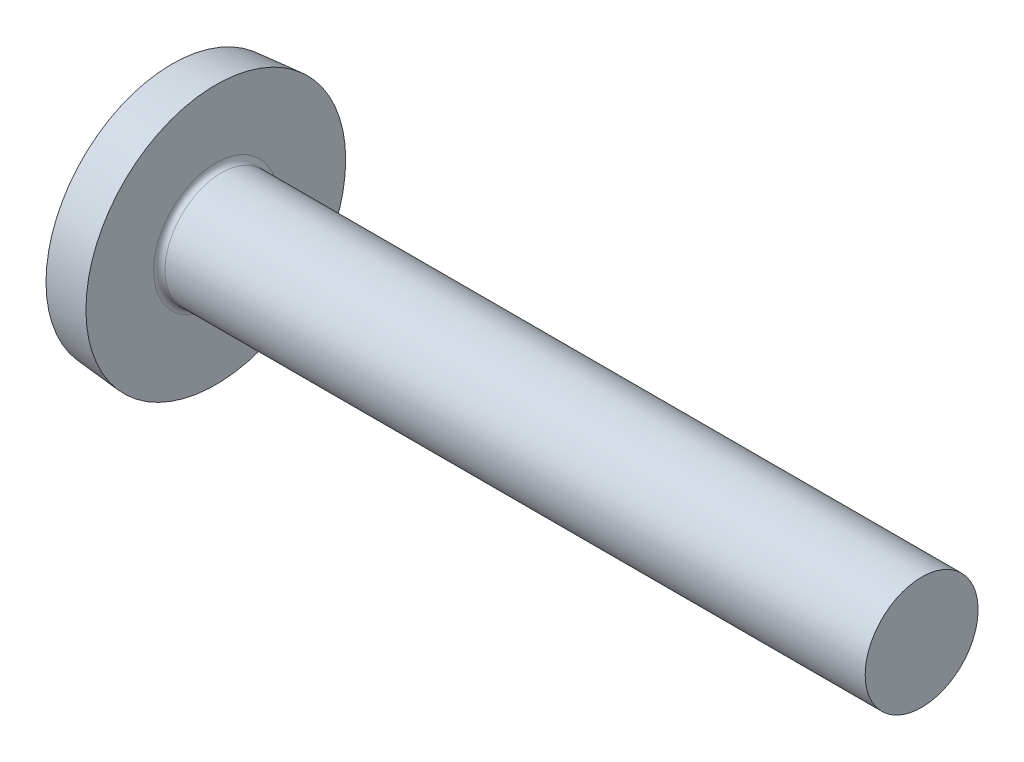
ISO-10303-21;
HEADER;
FILE_DESCRIPTION(('STEP AP214'),'2;1');
FILE_NAME('part.step','',(''),(''),'','','');
FILE_SCHEMA(('AUTOMOTIVE_DESIGN { 1 0 10303 214 1 1 1 1 }'));
ENDSEC;
DATA;
#1=APPLICATION_CONTEXT('core data for automotive mechanical design processes');
#2=APPLICATION_PROTOCOL_DEFINITION('international standard','automotive_design',2000,#1);
#3=PRODUCT_CONTEXT('',#1,'mechanical');
#4=PRODUCT('Part','Part','',(#3));
#5=PRODUCT_RELATED_PRODUCT_CATEGORY('part','',(#4));
#6=PRODUCT_DEFINITION_FORMATION('','',#4);
#7=PRODUCT_DEFINITION_CONTEXT('part definition',#1,'design');
#8=PRODUCT_DEFINITION('design','',#6,#7);
#9=PRODUCT_DEFINITION_SHAPE('','',#8);
#10=(LENGTH_UNIT() NAMED_UNIT(*) SI_UNIT(.MILLI.,.METRE.));
#11=(NAMED_UNIT(*) PLANE_ANGLE_UNIT() SI_UNIT($,.RADIAN.));
#12=(NAMED_UNIT(*) SI_UNIT($,.STERADIAN.) SOLID_ANGLE_UNIT());
#13=UNCERTAINTY_MEASURE_WITH_UNIT(LENGTH_MEASURE(1.E-05),#10,'distance_accuracy_value','');
#14=(GEOMETRIC_REPRESENTATION_CONTEXT(3) GLOBAL_UNCERTAINTY_ASSIGNED_CONTEXT((#13)) GLOBAL_UNIT_ASSIGNED_CONTEXT((#10,
#11,#12)) REPRESENTATION_CONTEXT('',''));
#15=CARTESIAN_POINT('',(0.,0.,0.));
#16=DIRECTION('',(0.,0.,1.));
#17=DIRECTION('',(1.,0.,0.));
#18=AXIS2_PLACEMENT_3D('',#15,#16,#17);
#19=CARTESIAN_POINT('',(24.2980012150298,0.,0.));
#20=DIRECTION('',(-1.,0.,0.));
#21=DIRECTION('',(0.,1.,0.));
#22=AXIS2_PLACEMENT_3D('',#19,#20,#21);
#23=SPHERICAL_SURFACE('',#22,24.2980012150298);
#24=CARTESIAN_POINT('',(1.7,0.,0.));
#25=DIRECTION('',(-1.,0.,0.));
#26=DIRECTION('',(0.,0.,1.));
#27=AXIS2_PLACEMENT_3D('',#24,#25,#26);
#28=CIRCLE('',#27,8.92878514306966);
#29=CARTESIAN_POINT('',(1.7,0.,8.92878514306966));
#30=VERTEX_POINT('',#29);
#31=EDGE_CURVE('E852',#30,#30,#28,.T.);
#32=ORIENTED_EDGE('',*,*,#31,.T.);
#33=EDGE_LOOP('',(#32));
#34=FACE_BOUND('',#33,.T.);
#35=CARTESIAN_POINT('',(0.0730330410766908,0.,0.));
#36=DIRECTION('',(1.,0.,0.));
#37=DIRECTION('',(0.,0.,-1.));
#38=AXIS2_PLACEMENT_3D('',#35,#36,#37);
#39=CIRCLE('',#38,1.88249303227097);
#40=CARTESIAN_POINT('',(0.0730330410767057,-0.857999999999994,-1.67559422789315));
#41=VERTEX_POINT('',#40);
#42=CARTESIAN_POINT('',(0.0730330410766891,-1.67559422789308,-0.858));
#43=VERTEX_POINT('',#42);
#44=EDGE_CURVE('E613',#41,#43,#39,.F.);
#45=ORIENTED_EDGE('',*,*,#44,.F.);
#46=CARTESIAN_POINT('',(24.2980012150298,-0.858000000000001,0.));
#47=DIRECTION('',(0.,1.,0.));
#48=DIRECTION('',(0.,0.,1.));
#49=AXIS2_PLACEMENT_3D('',#46,#47,#48);
#50=CIRCLE('',#49,24.2828478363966);
#51=CARTESIAN_POINT('',(0.306051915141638,-0.857999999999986,-3.74740814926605));
#52=VERTEX_POINT('',#51);
#53=EDGE_CURVE('E522',#52,#41,#50,.T.);
#54=ORIENTED_EDGE('',*,*,#53,.F.);
#55=CARTESIAN_POINT('',(21.0177911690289,0.,6.57908375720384));
#56=DIRECTION('',(-0.446197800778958,0.,0.89493436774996));
#57=DIRECTION('',(0.89493436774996,0.,0.446197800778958));
#58=AXIS2_PLACEMENT_3D('',#55,#56,#57);
#59=CIRCLE('',#58,23.1592042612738);
#60=CARTESIAN_POINT('',(0.306051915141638,0.858000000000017,-3.74740814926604));
#61=VERTEX_POINT('',#60);
#62=EDGE_CURVE('E61',#61,#52,#59,.T.);
#63=ORIENTED_EDGE('',*,*,#62,.F.);
#64=CARTESIAN_POINT('',(24.2980012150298,0.858,0.));
#65=DIRECTION('',(0.,-1.,0.));
#66=DIRECTION('',(0.,0.,-1.));
#67=AXIS2_PLACEMENT_3D('',#64,#65,#66);
#68=CIRCLE('',#67,24.2828478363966);
#69=CARTESIAN_POINT('',(0.0730330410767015,0.858000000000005,-1.67559422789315));
#70=VERTEX_POINT('',#69);
#71=EDGE_CURVE('E514',#70,#61,#68,.T.);
#72=ORIENTED_EDGE('',*,*,#71,.F.);
#73=CARTESIAN_POINT('',(0.0730330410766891,1.67559422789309,-0.858));
#74=VERTEX_POINT('',#73);
#75=EDGE_CURVE('E355',#74,#70,#39,.F.);
#76=ORIENTED_EDGE('',*,*,#75,.F.);
#77=CARTESIAN_POINT('',(24.2980012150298,0.,-0.858));
#78=DIRECTION('',(0.,0.,1.));
#79=DIRECTION('',(1.,0.,0.));
#80=AXIS2_PLACEMENT_3D('',#77,#78,#79);
#81=CIRCLE('',#80,24.2828478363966);
#82=CARTESIAN_POINT('',(0.306051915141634,3.74740814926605,-0.858));
#83=VERTEX_POINT('',#82);
#84=EDGE_CURVE('E628',#83,#74,#81,.T.);
#85=ORIENTED_EDGE('',*,*,#84,.F.);
#86=CARTESIAN_POINT('',(21.0177911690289,-6.57908375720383,0.));
#87=DIRECTION('',(-0.446197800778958,-0.89493436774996,0.));
#88=DIRECTION('',(0.89493436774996,-0.446197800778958,0.));
#89=AXIS2_PLACEMENT_3D('',#86,#87,#88);
#90=CIRCLE('',#89,23.1592042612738);
#91=CARTESIAN_POINT('',(0.306051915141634,3.74740814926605,0.858));
#92=VERTEX_POINT('',#91);
#93=EDGE_CURVE('E629',#92,#83,#90,.T.);
#94=ORIENTED_EDGE('',*,*,#93,.F.);
#95=CARTESIAN_POINT('',(24.2980012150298,0.,0.858000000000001));
#96=DIRECTION('',(0.,0.,-1.));
#97=DIRECTION('',(0.,1.,0.));
#98=AXIS2_PLACEMENT_3D('',#95,#96,#97);
#99=CIRCLE('',#98,24.2828478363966);
#100=CARTESIAN_POINT('',(0.0730330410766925,1.67559422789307,0.858));
#101=VERTEX_POINT('',#100);
#102=EDGE_CURVE('E77',#101,#92,#99,.T.);
#103=ORIENTED_EDGE('',*,*,#102,.F.);
#104=CARTESIAN_POINT('',(0.0730330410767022,0.857999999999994,1.67559422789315));
#105=VERTEX_POINT('',#104);
#106=EDGE_CURVE('E590',#105,#101,#39,.F.);
#107=ORIENTED_EDGE('',*,*,#106,.F.);
#108=CARTESIAN_POINT('',(0.306051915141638,0.857999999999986,3.74740814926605));
#109=VERTEX_POINT('',#108);
#110=EDGE_CURVE('E526',#109,#105,#68,.T.);
#111=ORIENTED_EDGE('',*,*,#110,.F.);
#112=CARTESIAN_POINT('',(21.0177911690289,0.,-6.57908375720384));
#113=DIRECTION('',(-0.446197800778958,0.,-0.89493436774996));
#114=DIRECTION('',(-0.89493436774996,0.,0.446197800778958));
#115=AXIS2_PLACEMENT_3D('',#112,#113,#114);
#116=CIRCLE('',#115,23.1592042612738);
#117=CARTESIAN_POINT('',(0.306051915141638,-0.858000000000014,3.74740814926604));
#118=VERTEX_POINT('',#117);
#119=EDGE_CURVE('E640',#118,#109,#116,.T.);
#120=ORIENTED_EDGE('',*,*,#119,.F.);
#121=CARTESIAN_POINT('',(0.073033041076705,-0.858000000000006,1.67559422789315));
#122=VERTEX_POINT('',#121);
#123=EDGE_CURVE('E525',#122,#118,#50,.T.);
#124=ORIENTED_EDGE('',*,*,#123,.F.);
#125=CARTESIAN_POINT('',(0.0730330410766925,-1.67559422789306,0.858));
#126=VERTEX_POINT('',#125);
#127=EDGE_CURVE('E610',#126,#122,#39,.F.);
#128=ORIENTED_EDGE('',*,*,#127,.F.);
#129=CARTESIAN_POINT('',(0.306051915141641,-3.74740814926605,0.858));
#130=VERTEX_POINT('',#129);
#131=EDGE_CURVE('E636',#130,#126,#99,.T.);
#132=ORIENTED_EDGE('',*,*,#131,.F.);
#133=CARTESIAN_POINT('',(21.0177911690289,6.57908375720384,0.));
#134=DIRECTION('',(-0.446197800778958,0.89493436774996,0.));
#135=DIRECTION('',(-0.89493436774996,-0.446197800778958,0.));
#136=AXIS2_PLACEMENT_3D('',#133,#134,#135);
#137=CIRCLE('',#136,23.1592042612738);
#138=CARTESIAN_POINT('',(0.306051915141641,-3.74740814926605,-0.858000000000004));
#139=VERTEX_POINT('',#138);
#140=EDGE_CURVE('E627',#139,#130,#137,.T.);
#141=ORIENTED_EDGE('',*,*,#140,.F.);
#142=EDGE_CURVE('E625',#43,#139,#81,.T.);
#143=ORIENTED_EDGE('',*,*,#142,.F.);
#144=EDGE_LOOP('',(#45,#54,#63,#72,#76,#85,#94,#103,#107,#111,#120,#124,#128,#132,#141,#143));
#145=FACE_BOUND('',#144,.T.);
#146=ADVANCED_FACE('F51',(#34,#145),#23,.T.);
#147=CARTESIAN_POINT('',(4.38,-1.71621263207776,0.858));
#148=DIRECTION('',(0.,0.,-1.));
#149=DIRECTION('',(0.,1.,0.));
#150=AXIS2_PLACEMENT_3D('',#147,#148,#149);
#151=PLANE('',#150);
#152=ORIENTED_EDGE('',*,*,#131,.T.);
#153=CARTESIAN_POINT('',(0.0300912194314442,-1.67896708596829,0.858));
#154=CARTESIAN_POINT('',(0.615803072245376,-1.63294813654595,0.858));
#155=CARTESIAN_POINT('',(1.20148851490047,-1.58658317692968,0.858));
#156=CARTESIAN_POINT('',(2.37277641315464,-1.49283617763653,0.858));
#157=CARTESIAN_POINT('',(2.95837886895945,-1.4454541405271,0.858));
#158=CARTESIAN_POINT('',(3.82269715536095,-1.3745234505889,0.858));
#159=CARTESIAN_POINT('',(4.10145559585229,-1.35149385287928,0.858));
#160=CARTESIAN_POINT('',(4.3802,-1.32829458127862,0.858));
#161=B_SPLINE_CURVE_WITH_KNOTS('',3,(#153,#154,#155,#156,#157,#158,#159,#160),.UNSPECIFIED.,.F.,
.F.,(4,2,2,4),(0.,1.76255189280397,3.52509933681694,4.36422358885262),.UNSPECIFIED.);
#162=CARTESIAN_POINT('',(4.38,-1.32831123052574,0.858));
#163=VERTEX_POINT('',#162);
#164=EDGE_CURVE('E614',#126,#163,#161,.T.);
#165=ORIENTED_EDGE('',*,*,#164,.T.);
#166=DIRECTION('',(0.,-1.,0.));
#167=VECTOR('',#166,1.);
#168=CARTESIAN_POINT('',(4.38,1.71621263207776,0.858));
#169=LINE('',#168,#167);
#170=CARTESIAN_POINT('',(4.38,-1.71621263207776,0.858));
#171=VERTEX_POINT('',#170);
#172=EDGE_CURVE('E403',#163,#171,#169,.T.);
#173=ORIENTED_EDGE('',*,*,#172,.T.);
#174=DIRECTION('',(0.89493436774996,0.446197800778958,0.));
#175=VECTOR('',#174,1.);
#176=CARTESIAN_POINT('',(0.,-3.9,0.858));
#177=LINE('',#176,#175);
#178=EDGE_CURVE('E538',#130,#171,#177,.T.);
#179=ORIENTED_EDGE('',*,*,#178,.F.);
#180=EDGE_LOOP('',(#152,#165,#173,#179));
#181=FACE_BOUND('',#180,.T.);
#182=ADVANCED_FACE('F181',(#181),#151,.T.);
#183=CARTESIAN_POINT('',(4.38,1.71621263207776,0.858));
#184=VERTEX_POINT('',#183);
#185=CARTESIAN_POINT('',(4.38,1.32831123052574,0.858));
#186=VERTEX_POINT('',#185);
#187=EDGE_CURVE('E557',#184,#186,#169,.T.);
#188=ORIENTED_EDGE('',*,*,#187,.T.);
#189=CARTESIAN_POINT('',(4.3802,1.32829458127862,0.858));
#190=CARTESIAN_POINT('',(3.88916460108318,1.36915794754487,0.858));
#191=CARTESIAN_POINT('',(3.39808595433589,1.40949733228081,0.858));
#192=CARTESIAN_POINT('',(2.415859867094,1.48932003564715,0.858));
#193=CARTESIAN_POINT('',(1.92471242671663,1.52880335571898,0.858));
#194=CARTESIAN_POINT('',(1.19964203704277,1.5865984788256,0.858));
#195=CARTESIAN_POINT('',(0.965739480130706,1.60516700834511,0.858));
#196=CARTESIAN_POINT('',(0.497923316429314,1.64216673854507,0.858));
#197=CARTESIAN_POINT('',(0.264009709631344,1.6605979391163,0.858));
#198=CARTESIAN_POINT('',(0.0300912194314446,1.67896708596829,0.858));
#199=B_SPLINE_CURVE_WITH_KNOTS('',3,(#189,#190,#191,#192,#193,#194,#195,#196,#197,#198),
.UNSPECIFIED.,.F.,.F.,(4,2,2,2,4),(0.,1.47819752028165,2.95639255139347,3.66030784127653,
4.36422369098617),.UNSPECIFIED.);
#200=EDGE_CURVE('E609',#186,#101,#199,.T.);
#201=ORIENTED_EDGE('',*,*,#200,.T.);
#202=ORIENTED_EDGE('',*,*,#102,.T.);
#203=DIRECTION('',(0.89493436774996,-0.446197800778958,0.));
#204=VECTOR('',#203,1.);
#205=CARTESIAN_POINT('',(0.,3.9,0.858));
#206=LINE('',#205,#204);
#207=EDGE_CURVE('E535',#92,#184,#206,.T.);
#208=ORIENTED_EDGE('',*,*,#207,.T.);
#209=EDGE_LOOP('',(#188,#201,#202,#208));
#210=FACE_BOUND('',#209,.T.);
#211=ADVANCED_FACE('F186',(#210),#151,.T.);
#212=CARTESIAN_POINT('',(4.38,1.71621263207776,-0.858));
#213=DIRECTION('',(0.,0.,1.));
#214=DIRECTION('',(1.,0.,0.));
#215=AXIS2_PLACEMENT_3D('',#212,#213,#214);
#216=PLANE('',#215);
#217=DIRECTION('',(0.,1.,0.));
#218=VECTOR('',#217,1.);
#219=CARTESIAN_POINT('',(4.38,1.71621263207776,-0.858));
#220=LINE('',#219,#218);
#221=CARTESIAN_POINT('',(4.38,-1.71621263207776,-0.858));
#222=VERTEX_POINT('',#221);
#223=CARTESIAN_POINT('',(4.38,-1.32831123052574,-0.858));
#224=VERTEX_POINT('',#223);
#225=EDGE_CURVE('E555',#222,#224,#220,.T.);
#226=ORIENTED_EDGE('',*,*,#225,.T.);
#227=CARTESIAN_POINT('',(4.3802,-1.32829458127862,-0.858));
#228=CARTESIAN_POINT('',(3.88916460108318,-1.36915794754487,-0.858));
#229=CARTESIAN_POINT('',(3.39808595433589,-1.40949733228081,-0.858));
#230=CARTESIAN_POINT('',(2.415859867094,-1.48932003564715,-0.858));
#231=CARTESIAN_POINT('',(1.92471242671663,-1.52880335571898,-0.858));
#232=CARTESIAN_POINT('',(1.19964203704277,-1.5865984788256,-0.858));
#233=CARTESIAN_POINT('',(0.965739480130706,-1.60516700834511,-0.858));
#234=CARTESIAN_POINT('',(0.497923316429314,-1.64216673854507,-0.858));
#235=CARTESIAN_POINT('',(0.264009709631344,-1.6605979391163,-0.858));
#236=CARTESIAN_POINT('',(0.0300912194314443,-1.67896708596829,-0.858));
#237=B_SPLINE_CURVE_WITH_KNOTS('',3,(#227,#228,#229,#230,#231,#232,#233,#234,#235,#236),
.UNSPECIFIED.,.F.,.F.,(4,2,2,2,4),(0.,1.47819752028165,2.95639255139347,3.66030784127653,
4.36422369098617),.UNSPECIFIED.);
#238=EDGE_CURVE('E618',#224,#43,#237,.T.);
#239=ORIENTED_EDGE('',*,*,#238,.T.);
#240=ORIENTED_EDGE('',*,*,#142,.T.);
#241=DIRECTION('',(0.89493436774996,0.446197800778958,0.));
#242=VECTOR('',#241,1.);
#243=CARTESIAN_POINT('',(0.,-3.9,-0.858000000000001));
#244=LINE('',#243,#242);
#245=EDGE_CURVE('E534',#139,#222,#244,.T.);
#246=ORIENTED_EDGE('',*,*,#245,.T.);
#247=EDGE_LOOP('',(#226,#239,#240,#246));
#248=FACE_BOUND('',#247,.T.);
#249=ADVANCED_FACE('F363',(#248),#216,.T.);
#250=ORIENTED_EDGE('',*,*,#84,.T.);
#251=CARTESIAN_POINT('',(0.0300912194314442,1.67896708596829,-0.858));
#252=CARTESIAN_POINT('',(0.615803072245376,1.63294813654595,-0.858));
#253=CARTESIAN_POINT('',(1.20148851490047,1.58658317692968,-0.858));
#254=CARTESIAN_POINT('',(2.37277641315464,1.49283617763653,-0.858));
#255=CARTESIAN_POINT('',(2.95837886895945,1.4454541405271,-0.858));
#256=CARTESIAN_POINT('',(3.82269715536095,1.3745234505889,-0.858));
#257=CARTESIAN_POINT('',(4.10145559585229,1.35149385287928,-0.858));
#258=CARTESIAN_POINT('',(4.3802,1.32829458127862,-0.858));
#259=B_SPLINE_CURVE_WITH_KNOTS('',3,(#251,#252,#253,#254,#255,#256,#257,#258),.UNSPECIFIED.,.F.,
.F.,(4,2,2,4),(0.,1.76255189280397,3.52509933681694,4.36422358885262),.UNSPECIFIED.);
#260=CARTESIAN_POINT('',(4.38,1.32831123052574,-0.858));
#261=VERTEX_POINT('',#260);
#262=EDGE_CURVE('E352',#74,#261,#259,.T.);
#263=ORIENTED_EDGE('',*,*,#262,.T.);
#264=CARTESIAN_POINT('',(4.38,1.71621263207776,-0.858));
#265=VERTEX_POINT('',#264);
#266=EDGE_CURVE('E391',#261,#265,#220,.T.);
#267=ORIENTED_EDGE('',*,*,#266,.T.);
#268=DIRECTION('',(0.89493436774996,-0.446197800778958,0.));
#269=VECTOR('',#268,1.);
#270=CARTESIAN_POINT('',(0.,3.9,-0.858));
#271=LINE('',#270,#269);
#272=EDGE_CURVE('E532',#83,#265,#271,.T.);
#273=ORIENTED_EDGE('',*,*,#272,.F.);
#274=EDGE_LOOP('',(#250,#263,#267,#273));
#275=FACE_BOUND('',#274,.T.);
#276=ADVANCED_FACE('F214',(#275),#216,.T.);
#277=CARTESIAN_POINT('',(4.38,-1.71621263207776,0.858));
#278=DIRECTION('',(1.,0.,0.));
#279=DIRECTION('',(0.,0.,-1.));
#280=AXIS2_PLACEMENT_3D('',#277,#278,#279);
#281=PLANE('',#280);
#282=CARTESIAN_POINT('',(4.38,0.,0.));
#283=DIRECTION('',(-1.,0.,0.));
#284=DIRECTION('',(0.,0.,1.));
#285=AXIS2_PLACEMENT_3D('',#282,#283,#284);
#286=CIRCLE('',#285,1.58132056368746);
#287=EDGE_CURVE('E566',#224,#163,#286,.T.);
#288=ORIENTED_EDGE('',*,*,#287,.F.);
#289=ORIENTED_EDGE('',*,*,#225,.F.);
#290=DIRECTION('',(0.,0.,-1.));
#291=VECTOR('',#290,1.);
#292=CARTESIAN_POINT('',(4.38,-1.71621263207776,0.858));
#293=LINE('',#292,#291);
#294=EDGE_CURVE('E422',#171,#222,#293,.T.);
#295=ORIENTED_EDGE('',*,*,#294,.F.);
#296=ORIENTED_EDGE('',*,*,#172,.F.);
#297=EDGE_LOOP('',(#288,#289,#295,#296));
#298=FACE_BOUND('',#297,.T.);
#299=ADVANCED_FACE('F209',(#298),#281,.F.);
#300=CARTESIAN_POINT('',(4.38,-0.858000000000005,1.32831123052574));
#301=VERTEX_POINT('',#300);
#302=CARTESIAN_POINT('',(4.38,0.857999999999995,1.32831123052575));
#303=VERTEX_POINT('',#302);
#304=EDGE_CURVE('E582',#301,#303,#286,.T.);
#305=ORIENTED_EDGE('',*,*,#304,.F.);
#306=DIRECTION('',(0.,0.,-1.));
#307=VECTOR('',#306,1.);
#308=CARTESIAN_POINT('',(4.38,-0.858000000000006,1.71621263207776));
#309=LINE('',#308,#307);
#310=CARTESIAN_POINT('',(4.38,-0.858000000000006,1.71621263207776));
#311=VERTEX_POINT('',#310);
#312=EDGE_CURVE('E55',#311,#301,#309,.T.);
#313=ORIENTED_EDGE('',*,*,#312,.F.);
#314=DIRECTION('',(0.,-1.,0.));
#315=VECTOR('',#314,1.);
#316=CARTESIAN_POINT('',(4.38,-0.858000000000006,1.71621263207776));
#317=LINE('',#316,#315);
#318=CARTESIAN_POINT('',(4.38,0.857999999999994,1.71621263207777));
#319=VERTEX_POINT('',#318);
#320=EDGE_CURVE('E495',#319,#311,#317,.T.);
#321=ORIENTED_EDGE('',*,*,#320,.F.);
#322=DIRECTION('',(0.,0.,1.));
#323=VECTOR('',#322,1.);
#324=CARTESIAN_POINT('',(4.38,0.857999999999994,1.71621263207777));
#325=LINE('',#324,#323);
#326=EDGE_CURVE('E288',#303,#319,#325,.T.);
#327=ORIENTED_EDGE('',*,*,#326,.F.);
#328=EDGE_LOOP('',(#305,#313,#321,#327));
#329=FACE_BOUND('',#328,.T.);
#330=ADVANCED_FACE('F213',(#329),#281,.F.);
#331=EDGE_CURVE('E560',#186,#261,#286,.T.);
#332=ORIENTED_EDGE('',*,*,#331,.F.);
#333=ORIENTED_EDGE('',*,*,#187,.F.);
#334=DIRECTION('',(0.,0.,1.));
#335=VECTOR('',#334,1.);
#336=CARTESIAN_POINT('',(4.38,1.71621263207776,0.858));
#337=LINE('',#336,#335);
#338=EDGE_CURVE('E545',#265,#184,#337,.T.);
#339=ORIENTED_EDGE('',*,*,#338,.F.);
#340=ORIENTED_EDGE('',*,*,#266,.F.);
#341=EDGE_LOOP('',(#332,#333,#339,#340));
#342=FACE_BOUND('',#341,.T.);
#343=ADVANCED_FACE('F558',(#342),#281,.F.);
#344=CARTESIAN_POINT('',(4.38,0.858000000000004,-1.32831123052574));
#345=VERTEX_POINT('',#344);
#346=CARTESIAN_POINT('',(4.38,-0.857999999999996,-1.32831123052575));
#347=VERTEX_POINT('',#346);
#348=EDGE_CURVE('E491',#345,#347,#286,.T.);
#349=ORIENTED_EDGE('',*,*,#348,.F.);
#350=CARTESIAN_POINT('',(4.38,0.858000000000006,-1.71621263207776));
#351=VERTEX_POINT('',#350);
#352=EDGE_CURVE('E488',#351,#345,#325,.T.);
#353=ORIENTED_EDGE('',*,*,#352,.F.);
#354=DIRECTION('',(0.,1.,0.));
#355=VECTOR('',#354,1.);
#356=CARTESIAN_POINT('',(4.38,-0.857999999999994,-1.71621263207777));
#357=LINE('',#356,#355);
#358=CARTESIAN_POINT('',(4.38,-0.857999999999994,-1.71621263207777));
#359=VERTEX_POINT('',#358);
#360=EDGE_CURVE('E489',#359,#351,#357,.T.);
#361=ORIENTED_EDGE('',*,*,#360,.F.);
#362=EDGE_CURVE('E354',#347,#359,#309,.T.);
#363=ORIENTED_EDGE('',*,*,#362,.F.);
#364=EDGE_LOOP('',(#349,#353,#361,#363));
#365=FACE_BOUND('',#364,.T.);
#366=ADVANCED_FACE('F216',(#365),#281,.F.);
#367=CARTESIAN_POINT('',(4.38,0.857999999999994,1.71621263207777));
#368=DIRECTION('',(0.,-1.,0.));
#369=DIRECTION('',(1.,0.,0.));
#370=AXIS2_PLACEMENT_3D('',#367,#368,#369);
#371=PLANE('',#370);
#372=ORIENTED_EDGE('',*,*,#352,.T.);
#373=CARTESIAN_POINT('',(4.3802,0.858000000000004,-1.32829458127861));
#374=CARTESIAN_POINT('',(3.88916460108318,0.858000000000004,-1.36915794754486));
#375=CARTESIAN_POINT('',(3.39808595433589,0.858000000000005,-1.4094973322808));
#376=CARTESIAN_POINT('',(2.415859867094,0.858000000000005,-1.48932003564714));
#377=CARTESIAN_POINT('',(1.92471242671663,0.858000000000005,-1.52880335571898));
#378=CARTESIAN_POINT('',(1.19964203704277,0.858000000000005,-1.5865984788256));
#379=CARTESIAN_POINT('',(0.965739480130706,0.858000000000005,-1.60516700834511));
#380=CARTESIAN_POINT('',(0.497923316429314,0.858000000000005,-1.64216673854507));
#381=CARTESIAN_POINT('',(0.264009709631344,0.858000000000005,-1.66059793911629));
#382=CARTESIAN_POINT('',(0.0300912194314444,0.858000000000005,-1.67896708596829));
#383=B_SPLINE_CURVE_WITH_KNOTS('',3,(#373,#374,#375,#376,#377,#378,#379,#380,#381,#382),
.UNSPECIFIED.,.F.,.F.,(4,2,2,2,4),(0.,1.47819752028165,2.95639255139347,3.66030784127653,
4.36422369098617),.UNSPECIFIED.);
#384=EDGE_CURVE('E351',#345,#70,#383,.T.);
#385=ORIENTED_EDGE('',*,*,#384,.T.);
#386=ORIENTED_EDGE('',*,*,#71,.T.);
#387=DIRECTION('',(0.89493436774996,0.,0.446197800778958));
#388=VECTOR('',#387,1.);
#389=CARTESIAN_POINT('',(0.,0.858000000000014,-3.9));
#390=LINE('',#389,#388);
#391=EDGE_CURVE('E500',#61,#351,#390,.T.);
#392=ORIENTED_EDGE('',*,*,#391,.T.);
#393=EDGE_LOOP('',(#372,#385,#386,#392));
#394=FACE_BOUND('',#393,.T.);
#395=ADVANCED_FACE('F298',(#394),#371,.T.);
#396=CARTESIAN_POINT('',(4.38,-0.857999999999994,-1.71621263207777));
#397=DIRECTION('',(0.,1.,0.));
#398=DIRECTION('',(0.,0.,1.));
#399=AXIS2_PLACEMENT_3D('',#396,#397,#398);
#400=PLANE('',#399);
#401=ORIENTED_EDGE('',*,*,#53,.T.);
#402=CARTESIAN_POINT('',(0.0300912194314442,-0.857999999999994,-1.6789670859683));
#403=CARTESIAN_POINT('',(0.615803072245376,-0.857999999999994,-1.63294813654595));
#404=CARTESIAN_POINT('',(1.20148851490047,-0.857999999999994,-1.58658317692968));
#405=CARTESIAN_POINT('',(2.37277641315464,-0.857999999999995,-1.49283617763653));
#406=CARTESIAN_POINT('',(2.95837886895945,-0.857999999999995,-1.44545414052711));
#407=CARTESIAN_POINT('',(3.82269715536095,-0.857999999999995,-1.3745234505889));
#408=CARTESIAN_POINT('',(4.10145559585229,-0.857999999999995,-1.35149385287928));
#409=CARTESIAN_POINT('',(4.3802,-0.857999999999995,-1.32829458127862));
#410=B_SPLINE_CURVE_WITH_KNOTS('',3,(#402,#403,#404,#405,#406,#407,#408,#409),.UNSPECIFIED.,.F.,
.F.,(4,2,2,4),(0.,1.76255189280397,3.52509933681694,4.36422358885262),.UNSPECIFIED.);
#411=EDGE_CURVE('E617',#41,#347,#410,.T.);
#412=ORIENTED_EDGE('',*,*,#411,.T.);
#413=ORIENTED_EDGE('',*,*,#362,.T.);
#414=DIRECTION('',(0.89493436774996,0.,0.446197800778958));
#415=VECTOR('',#414,1.);
#416=CARTESIAN_POINT('',(0.,-0.857999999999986,-3.9));
#417=LINE('',#416,#415);
#418=EDGE_CURVE('E503',#52,#359,#417,.T.);
#419=ORIENTED_EDGE('',*,*,#418,.F.);
#420=EDGE_LOOP('',(#401,#412,#413,#419));
#421=FACE_BOUND('',#420,.T.);
#422=ADVANCED_FACE('F459',(#421),#400,.T.);
#423=ORIENTED_EDGE('',*,*,#312,.T.);
#424=CARTESIAN_POINT('',(4.3802,-0.858000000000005,1.32829458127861));
#425=CARTESIAN_POINT('',(3.88916460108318,-0.858000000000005,1.36915794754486));
#426=CARTESIAN_POINT('',(3.39808595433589,-0.858000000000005,1.4094973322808));
#427=CARTESIAN_POINT('',(2.415859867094,-0.858000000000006,1.48932003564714));
#428=CARTESIAN_POINT('',(1.92471242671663,-0.858000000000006,1.52880335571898));
#429=CARTESIAN_POINT('',(1.19964203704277,-0.858000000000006,1.5865984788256));
#430=CARTESIAN_POINT('',(0.965739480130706,-0.858000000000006,1.60516700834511));
#431=CARTESIAN_POINT('',(0.497923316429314,-0.858000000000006,1.64216673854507));
#432=CARTESIAN_POINT('',(0.264009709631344,-0.858000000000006,1.66059793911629));
#433=CARTESIAN_POINT('',(0.0300912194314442,-0.858000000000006,1.67896708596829));
#434=B_SPLINE_CURVE_WITH_KNOTS('',3,(#424,#425,#426,#427,#428,#429,#430,#431,#432,#433),
.UNSPECIFIED.,.F.,.F.,(4,2,2,2,4),(0.,1.47819752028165,2.95639255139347,3.66030784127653,
4.36422369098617),.UNSPECIFIED.);
#435=EDGE_CURVE('E612',#301,#122,#434,.T.);
#436=ORIENTED_EDGE('',*,*,#435,.T.);
#437=ORIENTED_EDGE('',*,*,#123,.T.);
#438=DIRECTION('',(0.89493436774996,0.,-0.446197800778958));
#439=VECTOR('',#438,1.);
#440=CARTESIAN_POINT('',(0.,-0.858000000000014,3.9));
#441=LINE('',#440,#439);
#442=EDGE_CURVE('E512',#118,#311,#441,.T.);
#443=ORIENTED_EDGE('',*,*,#442,.T.);
#444=EDGE_LOOP('',(#423,#436,#437,#443));
#445=FACE_BOUND('',#444,.T.);
#446=ADVANCED_FACE('F467',(#445),#400,.T.);
#447=ORIENTED_EDGE('',*,*,#110,.T.);
#448=CARTESIAN_POINT('',(0.0300912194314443,0.857999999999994,1.6789670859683));
#449=CARTESIAN_POINT('',(0.615803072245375,0.857999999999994,1.63294813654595));
#450=CARTESIAN_POINT('',(1.20148851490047,0.857999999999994,1.58658317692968));
#451=CARTESIAN_POINT('',(2.37277641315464,0.857999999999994,1.49283617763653));
#452=CARTESIAN_POINT('',(2.95837886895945,0.857999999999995,1.44545414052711));
#453=CARTESIAN_POINT('',(3.82269715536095,0.857999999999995,1.3745234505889));
#454=CARTESIAN_POINT('',(4.10145559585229,0.857999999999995,1.35149385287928));
#455=CARTESIAN_POINT('',(4.3802,0.857999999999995,1.32829458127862));
#456=B_SPLINE_CURVE_WITH_KNOTS('',3,(#448,#449,#450,#451,#452,#453,#454,#455),.UNSPECIFIED.,.F.,
.F.,(4,2,2,4),(0.,1.76255189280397,3.52509933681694,4.36422358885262),.UNSPECIFIED.);
#457=EDGE_CURVE('E12',#105,#303,#456,.T.);
#458=ORIENTED_EDGE('',*,*,#457,.T.);
#459=ORIENTED_EDGE('',*,*,#326,.T.);
#460=DIRECTION('',(0.89493436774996,0.,-0.446197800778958));
#461=VECTOR('',#460,1.);
#462=CARTESIAN_POINT('',(0.,0.857999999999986,3.9));
#463=LINE('',#462,#461);
#464=EDGE_CURVE('E509',#109,#319,#463,.T.);
#465=ORIENTED_EDGE('',*,*,#464,.F.);
#466=EDGE_LOOP('',(#447,#458,#459,#465));
#467=FACE_BOUND('',#466,.T.);
#468=ADVANCED_FACE('F196',(#467),#371,.T.);
#469=CARTESIAN_POINT('',(4.8,0.,0.));
#470=DIRECTION('',(1.,0.,0.));
#471=DIRECTION('',(0.,0.,-1.));
#472=AXIS2_PLACEMENT_3D('',#469,#470,#471);
#473=CONICAL_SURFACE('',#472,9.2,0.0872664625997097);
#474=ORIENTED_EDGE('',*,*,#31,.F.);
#475=EDGE_LOOP('',(#474));
#476=FACE_BOUND('',#475,.T.);
#477=CARTESIAN_POINT('',(4.8,0.,0.));
#478=DIRECTION('',(-1.,0.,0.));
#479=DIRECTION('',(0.,0.,1.));
#480=AXIS2_PLACEMENT_3D('',#477,#478,#479);
#481=CIRCLE('',#480,9.2);
#482=CARTESIAN_POINT('',(4.8,0.,9.2));
#483=VERTEX_POINT('',#482);
#484=EDGE_CURVE('E854',#483,#483,#481,.T.);
#485=ORIENTED_EDGE('',*,*,#484,.T.);
#486=EDGE_LOOP('',(#485));
#487=FACE_BOUND('',#486,.T.);
#488=ADVANCED_FACE('F192',(#476,#487),#473,.T.);
#489=CARTESIAN_POINT('',(4.8,4.,0.));
#490=DIRECTION('',(-1.,0.,0.));
#491=DIRECTION('',(0.,0.,1.));
#492=AXIS2_PLACEMENT_3D('',#489,#490,#491);
#493=PLANE('',#492);
#494=CARTESIAN_POINT('',(4.8,0.,0.));
#495=DIRECTION('',(-1.,0.,0.));
#496=DIRECTION('',(0.,0.,1.));
#497=AXIS2_PLACEMENT_3D('',#494,#495,#496);
#498=CIRCLE('',#497,4.4);
#499=CARTESIAN_POINT('',(4.8,0.,4.4));
#500=VERTEX_POINT('',#499);
#501=EDGE_CURVE('E851',#500,#500,#498,.T.);
#502=ORIENTED_EDGE('',*,*,#501,.T.);
#503=EDGE_LOOP('',(#502));
#504=FACE_BOUND('',#503,.T.);
#505=ORIENTED_EDGE('',*,*,#484,.F.);
#506=EDGE_LOOP('',(#505));
#507=FACE_BOUND('',#506,.T.);
#508=ADVANCED_FACE('F195',(#504,#507),#493,.F.);
#509=CARTESIAN_POINT('',(0.,0.,0.));
#510=DIRECTION('',(-1.,0.,0.));
#511=DIRECTION('',(0.,0.,1.));
#512=AXIS2_PLACEMENT_3D('',#509,#510,#511);
#513=CYLINDRICAL_SURFACE('',#512,4.);
#514=CARTESIAN_POINT('',(5.2,0.,0.));
#515=DIRECTION('',(-1.,0.,0.));
#516=DIRECTION('',(0.,0.,1.));
#517=AXIS2_PLACEMENT_3D('',#514,#515,#516);
#518=CIRCLE('',#517,4.);
#519=CARTESIAN_POINT('',(5.2,0.,4.));
#520=VERTEX_POINT('',#519);
#521=EDGE_CURVE('E632',#520,#520,#518,.F.);
#522=ORIENTED_EDGE('',*,*,#521,.T.);
#523=EDGE_LOOP('',(#522));
#524=FACE_BOUND('',#523,.T.);
#525=CARTESIAN_POINT('',(54.8,0.,0.));
#526=DIRECTION('',(-1.,0.,0.));
#527=DIRECTION('',(0.,0.,1.));
#528=AXIS2_PLACEMENT_3D('',#525,#526,#527);
#529=CIRCLE('',#528,4.);
#530=CARTESIAN_POINT('',(54.8,0.,4.));
#531=VERTEX_POINT('',#530);
#532=EDGE_CURVE('E858',#531,#531,#529,.T.);
#533=ORIENTED_EDGE('',*,*,#532,.T.);
#534=EDGE_LOOP('',(#533));
#535=FACE_BOUND('',#534,.T.);
#536=ADVANCED_FACE('F200',(#524,#535),#513,.T.);
#537=CARTESIAN_POINT('',(54.8,4.,0.));
#538=DIRECTION('',(-1.,0.,0.));
#539=DIRECTION('',(0.,0.,1.));
#540=AXIS2_PLACEMENT_3D('',#537,#538,#539);
#541=PLANE('',#540);
#542=ORIENTED_EDGE('',*,*,#532,.F.);
#543=EDGE_LOOP('',(#542));
#544=FACE_BOUND('',#543,.T.);
#545=ADVANCED_FACE('F204',(#544),#541,.F.);
#546=CARTESIAN_POINT('',(5.2,0.,0.));
#547=DIRECTION('',(-1.,0.,0.));
#548=DIRECTION('',(0.,0.,1.));
#549=AXIS2_PLACEMENT_3D('',#546,#547,#548);
#550=TOROIDAL_SURFACE('',#549,4.4,0.4);
#551=ORIENTED_EDGE('',*,*,#521,.F.);
#552=EDGE_LOOP('',(#551));
#553=FACE_BOUND('',#552,.T.);
#554=ORIENTED_EDGE('',*,*,#501,.F.);
#555=EDGE_LOOP('',(#554));
#556=FACE_BOUND('',#555,.T.);
#557=ADVANCED_FACE('F53',(#553,#556),#550,.F.);
#558=CARTESIAN_POINT('',(0.,-3.9,-0.858));
#559=DIRECTION('',(-0.446197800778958,0.89493436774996,0.));
#560=DIRECTION('',(-0.89493436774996,-0.446197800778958,0.));
#561=AXIS2_PLACEMENT_3D('',#558,#559,#560);
#562=PLANE('',#561);
#563=ORIENTED_EDGE('',*,*,#140,.T.);
#564=ORIENTED_EDGE('',*,*,#178,.T.);
#565=ORIENTED_EDGE('',*,*,#294,.T.);
#566=ORIENTED_EDGE('',*,*,#245,.F.);
#567=EDGE_LOOP('',(#563,#564,#565,#566));
#568=FACE_BOUND('',#567,.T.);
#569=ADVANCED_FACE('F425',(#568),#562,.T.);
#570=CARTESIAN_POINT('',(4.38,1.71621263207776,0.858));
#571=DIRECTION('',(-0.446197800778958,-0.89493436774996,0.));
#572=DIRECTION('',(0.89493436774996,-0.446197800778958,0.));
#573=AXIS2_PLACEMENT_3D('',#570,#571,#572);
#574=PLANE('',#573);
#575=ORIENTED_EDGE('',*,*,#93,.T.);
#576=ORIENTED_EDGE('',*,*,#272,.T.);
#577=ORIENTED_EDGE('',*,*,#338,.T.);
#578=ORIENTED_EDGE('',*,*,#207,.F.);
#579=EDGE_LOOP('',(#575,#576,#577,#578));
#580=FACE_BOUND('',#579,.T.);
#581=ADVANCED_FACE('F217',(#580),#574,.T.);
#582=CARTESIAN_POINT('',(0.,0.858000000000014,-3.9));
#583=DIRECTION('',(-0.446197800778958,0.,0.89493436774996));
#584=DIRECTION('',(-0.89493436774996,0.,-0.446197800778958));
#585=AXIS2_PLACEMENT_3D('',#582,#583,#584);
#586=PLANE('',#585);
#587=ORIENTED_EDGE('',*,*,#62,.T.);
#588=ORIENTED_EDGE('',*,*,#418,.T.);
#589=ORIENTED_EDGE('',*,*,#360,.T.);
#590=ORIENTED_EDGE('',*,*,#391,.F.);
#591=EDGE_LOOP('',(#587,#588,#589,#590));
#592=FACE_BOUND('',#591,.T.);
#593=ADVANCED_FACE('F304',(#592),#586,.T.);
#594=CARTESIAN_POINT('',(4.38,-0.858000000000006,1.71621263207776));
#595=DIRECTION('',(-0.446197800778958,0.,-0.89493436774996));
#596=DIRECTION('',(0.89493436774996,0.,-0.446197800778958));
#597=AXIS2_PLACEMENT_3D('',#594,#595,#596);
#598=PLANE('',#597);
#599=ORIENTED_EDGE('',*,*,#119,.T.);
#600=ORIENTED_EDGE('',*,*,#464,.T.);
#601=ORIENTED_EDGE('',*,*,#320,.T.);
#602=ORIENTED_EDGE('',*,*,#442,.F.);
#603=EDGE_LOOP('',(#599,#600,#601,#602));
#604=FACE_BOUND('',#603,.T.);
#605=ADVANCED_FACE('F433',(#604),#598,.T.);
#606=CARTESIAN_POINT('',(4.38,0.,0.));
#607=DIRECTION('',(-1.,0.,0.));
#608=DIRECTION('',(0.,0.,1.));
#609=AXIS2_PLACEMENT_3D('',#606,#607,#608);
#610=CONICAL_SURFACE('',#609,1.58132056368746,0.0698131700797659);
#611=ORIENTED_EDGE('',*,*,#75,.T.);
#612=ORIENTED_EDGE('',*,*,#384,.F.);
#613=EDGE_CURVE('E600',#261,#345,#286,.T.);
#614=ORIENTED_EDGE('',*,*,#613,.F.);
#615=ORIENTED_EDGE('',*,*,#262,.F.);
#616=EDGE_LOOP('',(#611,#612,#614,#615));
#617=FACE_BOUND('',#616,.T.);
#618=ADVANCED_FACE('F179',(#617),#610,.F.);
#619=EDGE_CURVE('E605',#347,#224,#286,.T.);
#620=ORIENTED_EDGE('',*,*,#619,.F.);
#621=ORIENTED_EDGE('',*,*,#411,.F.);
#622=ORIENTED_EDGE('',*,*,#44,.T.);
#623=ORIENTED_EDGE('',*,*,#238,.F.);
#624=EDGE_LOOP('',(#620,#621,#622,#623));
#625=FACE_BOUND('',#624,.T.);
#626=ADVANCED_FACE('F622',(#625),#610,.F.);
#627=ORIENTED_EDGE('',*,*,#127,.T.);
#628=ORIENTED_EDGE('',*,*,#435,.F.);
#629=EDGE_CURVE('E584',#163,#301,#286,.T.);
#630=ORIENTED_EDGE('',*,*,#629,.F.);
#631=ORIENTED_EDGE('',*,*,#164,.F.);
#632=EDGE_LOOP('',(#627,#628,#630,#631));
#633=FACE_BOUND('',#632,.T.);
#634=ADVANCED_FACE('F177',(#633),#610,.F.);
#635=EDGE_CURVE('E69',#303,#186,#286,.T.);
#636=ORIENTED_EDGE('',*,*,#635,.F.);
#637=ORIENTED_EDGE('',*,*,#457,.F.);
#638=ORIENTED_EDGE('',*,*,#106,.T.);
#639=ORIENTED_EDGE('',*,*,#200,.F.);
#640=EDGE_LOOP('',(#636,#637,#638,#639));
#641=FACE_BOUND('',#640,.T.);
#642=ADVANCED_FACE('F171',(#641),#610,.F.);
#643=CARTESIAN_POINT('',(4.89380219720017,0.,0.));
#644=DIRECTION('',(-1.,0.,0.));
#645=DIRECTION('',(0.,0.,1.));
#646=AXIS2_PLACEMENT_3D('',#643,#644,#645);
#647=CONICAL_SURFACE('',#646,0.,1.25663706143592);
#648=ORIENTED_EDGE('',*,*,#635,.T.);
#649=ORIENTED_EDGE('',*,*,#331,.T.);
#650=ORIENTED_EDGE('',*,*,#613,.T.);
#651=ORIENTED_EDGE('',*,*,#348,.T.);
#652=ORIENTED_EDGE('',*,*,#619,.T.);
#653=ORIENTED_EDGE('',*,*,#287,.T.);
#654=ORIENTED_EDGE('',*,*,#629,.T.);
#655=ORIENTED_EDGE('',*,*,#304,.T.);
#656=EDGE_LOOP('',(#648,#649,#650,#651,#652,#653,#654,#655));
#657=FACE_BOUND('',#656,.T.);
#658=CARTESIAN_POINT('',(4.89380219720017,0.,0.));
#659=VERTEX_POINT('',#658);
#660=VERTEX_LOOP('',#659);
#661=FACE_BOUND('',#660,.T.);
#662=ADVANCED_FACE('F169',(#657,#661),#647,.F.);
#663=CLOSED_SHELL('',(#146,#182,#211,#249,#276,#299,#330,#343,#366,#395,#422,#446,#468,#488,
#508,#536,#545,#557,#569,#581,#593,#605,#618,#626,#634,#642,#662));
#664=MANIFOLD_SOLID_BREP('B2',#663);
#665=ADVANCED_BREP_SHAPE_REPRESENTATION('',(#18,#664),#14);
#666=SHAPE_DEFINITION_REPRESENTATION(#9,#665);
ENDSEC;
END-ISO-10303-21;
